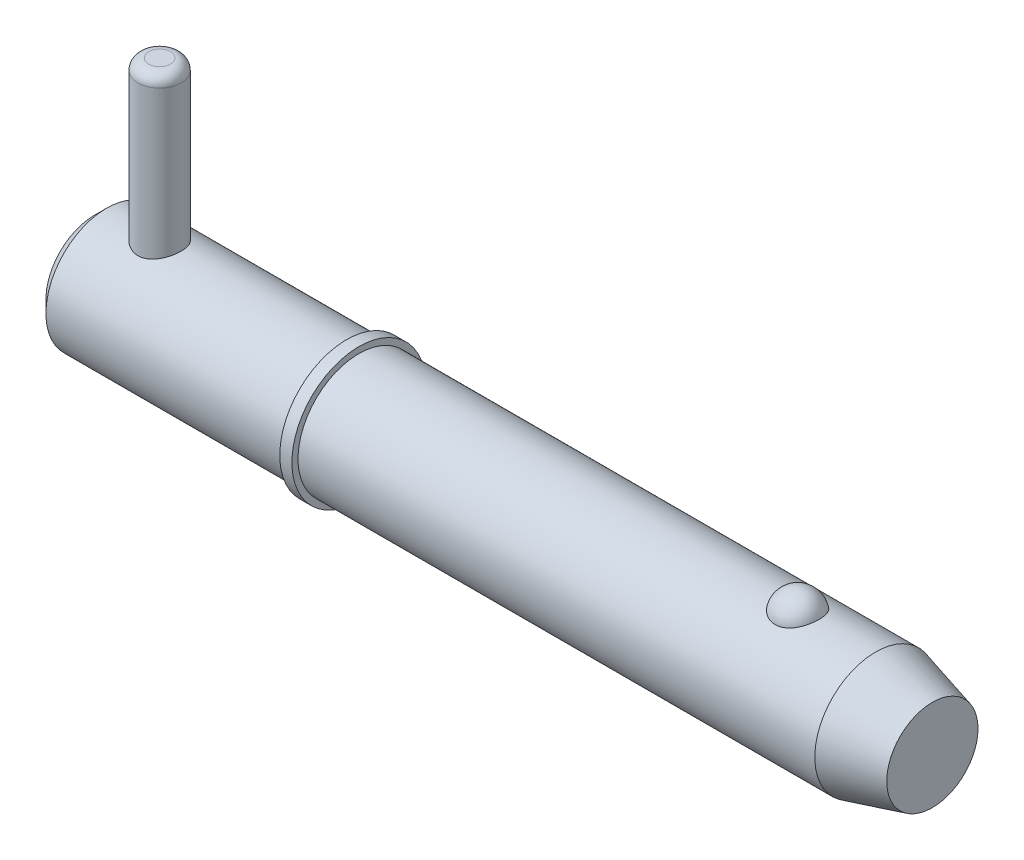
ISO-10303-21;
HEADER;
FILE_DESCRIPTION(('STEP AP214'),'2;1');
FILE_NAME('part.step','',(''),(''),'','','');
FILE_SCHEMA(('AUTOMOTIVE_DESIGN { 1 0 10303 214 1 1 1 1 }'));
ENDSEC;
DATA;
#1=APPLICATION_CONTEXT('core data for automotive mechanical design processes');
#2=APPLICATION_PROTOCOL_DEFINITION('international standard','automotive_design',2000,#1);
#3=PRODUCT_CONTEXT('',#1,'mechanical');
#4=PRODUCT('Part','Part','',(#3));
#5=PRODUCT_RELATED_PRODUCT_CATEGORY('part','',(#4));
#6=PRODUCT_DEFINITION_FORMATION('','',#4);
#7=PRODUCT_DEFINITION_CONTEXT('part definition',#1,'design');
#8=PRODUCT_DEFINITION('design','',#6,#7);
#9=PRODUCT_DEFINITION_SHAPE('','',#8);
#10=(LENGTH_UNIT() NAMED_UNIT(*) SI_UNIT(.MILLI.,.METRE.));
#11=(NAMED_UNIT(*) PLANE_ANGLE_UNIT() SI_UNIT($,.RADIAN.));
#12=(NAMED_UNIT(*) SI_UNIT($,.STERADIAN.) SOLID_ANGLE_UNIT());
#13=UNCERTAINTY_MEASURE_WITH_UNIT(LENGTH_MEASURE(1.E-05),#10,'distance_accuracy_value','');
#14=(GEOMETRIC_REPRESENTATION_CONTEXT(3) GLOBAL_UNCERTAINTY_ASSIGNED_CONTEXT((#13)) GLOBAL_UNIT_ASSIGNED_CONTEXT((#10,
#11,#12)) REPRESENTATION_CONTEXT('',''));
#15=CARTESIAN_POINT('',(0.,0.,0.));
#16=DIRECTION('',(0.,0.,1.));
#17=DIRECTION('',(1.,0.,0.));
#18=AXIS2_PLACEMENT_3D('',#15,#16,#17);
#19=CARTESIAN_POINT('',(5.94,19.845,0.));
#20=DIRECTION('',(0.,-1.,0.));
#21=DIRECTION('',(0.,0.,-1.));
#22=AXIS2_PLACEMENT_3D('',#19,#20,#21);
#23=CYLINDRICAL_SURFACE('',#22,1.98);
#24=CARTESIAN_POINT('',(5.94,-4.565,0.));
#25=DIRECTION('',(0.,1.,0.));
#26=DIRECTION('',(0.,0.,1.));
#27=AXIS2_PLACEMENT_3D('',#24,#25,#26);
#28=CIRCLE('',#27,1.98);
#29=CARTESIAN_POINT('',(5.94,-4.565,1.98));
#30=VERTEX_POINT('',#29);
#31=EDGE_CURVE('P0_E25',#30,#30,#28,.T.);
#32=ORIENTED_EDGE('',*,*,#31,.T.);
#33=EDGE_LOOP('',(#32));
#34=FACE_BOUND('',#33,.T.);
#35=CARTESIAN_POINT('',(5.94,18.855,0.));
#36=DIRECTION('',(0.,1.,0.));
#37=DIRECTION('',(0.,0.,1.));
#38=AXIS2_PLACEMENT_3D('',#35,#36,#37);
#39=CIRCLE('',#38,1.98);
#40=CARTESIAN_POINT('',(5.94,18.855,1.98));
#41=VERTEX_POINT('',#40);
#42=EDGE_CURVE('P0_E29',#41,#41,#39,.F.);
#43=ORIENTED_EDGE('',*,*,#42,.T.);
#44=EDGE_LOOP('',(#43));
#45=FACE_BOUND('',#44,.T.);
#46=ADVANCED_FACE('P0_F14',(#34,#45),#23,.T.);
#47=CARTESIAN_POINT('',(5.94,19.845,0.));
#48=DIRECTION('',(0.,1.,0.));
#49=DIRECTION('',(0.,0.,1.));
#50=AXIS2_PLACEMENT_3D('',#47,#48,#49);
#51=PLANE('',#50);
#52=CARTESIAN_POINT('',(5.94,19.845,0.));
#53=DIRECTION('',(0.,1.,0.));
#54=DIRECTION('',(0.,0.,1.));
#55=AXIS2_PLACEMENT_3D('',#52,#53,#54);
#56=CIRCLE('',#55,0.99);
#57=CARTESIAN_POINT('',(5.94,19.845,0.99));
#58=VERTEX_POINT('',#57);
#59=EDGE_CURVE('P0_E10',#58,#58,#56,.T.);
#60=ORIENTED_EDGE('',*,*,#59,.T.);
#61=EDGE_LOOP('',(#60));
#62=FACE_BOUND('',#61,.T.);
#63=ADVANCED_FACE('P0_F46',(#62),#51,.T.);
#64=CARTESIAN_POINT('',(5.94,-5.555,0.));
#65=DIRECTION('',(0.,1.,0.));
#66=DIRECTION('',(0.,0.,1.));
#67=AXIS2_PLACEMENT_3D('',#64,#65,#66);
#68=PLANE('',#67);
#69=CARTESIAN_POINT('',(5.94,-5.555,0.));
#70=DIRECTION('',(0.,1.,0.));
#71=DIRECTION('',(0.,0.,1.));
#72=AXIS2_PLACEMENT_3D('',#69,#70,#71);
#73=CIRCLE('',#72,0.99);
#74=CARTESIAN_POINT('',(5.94,-5.555,0.99));
#75=VERTEX_POINT('',#74);
#76=EDGE_CURVE('P0_E21',#75,#75,#73,.F.);
#77=ORIENTED_EDGE('',*,*,#76,.T.);
#78=EDGE_LOOP('',(#77));
#79=FACE_BOUND('',#78,.T.);
#80=ADVANCED_FACE('P0_F43',(#79),#68,.F.);
#81=CARTESIAN_POINT('',(5.94,-4.565,0.));
#82=DIRECTION('',(0.,1.,0.));
#83=DIRECTION('',(0.,0.,1.));
#84=AXIS2_PLACEMENT_3D('',#81,#82,#83);
#85=DEGENERATE_TOROIDAL_SURFACE('',#84,0.99,0.99,.T.);
#86=ORIENTED_EDGE('',*,*,#76,.F.);
#87=EDGE_LOOP('',(#86));
#88=FACE_BOUND('',#87,.T.);
#89=ORIENTED_EDGE('',*,*,#31,.F.);
#90=EDGE_LOOP('',(#89));
#91=FACE_BOUND('',#90,.T.);
#92=ADVANCED_FACE('P0_F38',(#88,#91),#85,.T.);
#93=CARTESIAN_POINT('',(5.94,18.855,0.));
#94=DIRECTION('',(0.,1.,0.));
#95=DIRECTION('',(0.,0.,1.));
#96=AXIS2_PLACEMENT_3D('',#93,#94,#95);
#97=DEGENERATE_TOROIDAL_SURFACE('',#96,0.99,0.99,.T.);
#98=ORIENTED_EDGE('',*,*,#42,.F.);
#99=EDGE_LOOP('',(#98));
#100=FACE_BOUND('',#99,.T.);
#101=ORIENTED_EDGE('',*,*,#59,.F.);
#102=EDGE_LOOP('',(#101));
#103=FACE_BOUND('',#102,.T.);
#104=ADVANCED_FACE('P0_F16',(#100,#103),#97,.T.);
#105=CLOSED_SHELL('',(#46,#63,#80,#92,#104));
#106=MANIFOLD_SOLID_BREP('P0_B1',#105);
#107=CARTESIAN_POINT('',(0.,0.,0.));
#108=DIRECTION('',(1.,0.,0.));
#109=DIRECTION('',(0.,0.,-1.));
#110=AXIS2_PLACEMENT_3D('',#107,#108,#109);
#111=CYLINDRICAL_SURFACE('',#110,5.555);
#112=CARTESIAN_POINT('',(71.3171144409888,0.,0.));
#113=DIRECTION('',(1.,0.,0.));
#114=DIRECTION('',(0.,0.,-1.));
#115=AXIS2_PLACEMENT_3D('',#112,#113,#114);
#116=CIRCLE('',#115,5.555);
#117=CARTESIAN_POINT('',(71.3171144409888,0.,-5.555));
#118=VERTEX_POINT('',#117);
#119=EDGE_CURVE('P1_E81',#118,#118,#116,.T.);
#120=ORIENTED_EDGE('',*,*,#119,.F.);
#121=EDGE_LOOP('',(#120));
#122=FACE_BOUND('',#121,.T.);
#123=CARTESIAN_POINT('',(24.13,0.,0.));
#124=DIRECTION('',(1.,0.,0.));
#125=DIRECTION('',(0.,0.,-1.));
#126=AXIS2_PLACEMENT_3D('',#123,#124,#125);
#127=CIRCLE('',#126,5.555);
#128=CARTESIAN_POINT('',(24.13,0.,-5.555));
#129=VERTEX_POINT('',#128);
#130=EDGE_CURVE('P1_E85',#129,#129,#127,.T.);
#131=ORIENTED_EDGE('',*,*,#130,.T.);
#132=EDGE_LOOP('',(#131));
#133=FACE_BOUND('',#132,.T.);
#134=CARTESIAN_POINT('',(64.1986264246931,5.16741224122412,2.03859650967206));
#135=CARTESIAN_POINT('',(64.0929492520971,5.16740893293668,2.03859990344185));
#136=CARTESIAN_POINT('',(63.98729894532,5.17079470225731,2.03008306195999));
#137=CARTESIAN_POINT('',(63.7791419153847,5.18392795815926,1.99630721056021));
#138=CARTESIAN_POINT('',(63.6766344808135,5.19367399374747,1.97105201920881));
#139=CARTESIAN_POINT('',(63.4777710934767,5.21839168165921,1.90463997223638));
#140=CARTESIAN_POINT('',(63.3814064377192,5.23335573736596,1.86350622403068));
#141=CARTESIAN_POINT('',(63.1970804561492,5.26688076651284,1.76652592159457));
#142=CARTESIAN_POINT('',(63.1091207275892,5.28544242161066,1.71067657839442));
#143=CARTESIAN_POINT('',(62.941265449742,5.32479845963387,1.58399959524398));
#144=CARTESIAN_POINT('',(62.8616656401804,5.34564089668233,1.5127954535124));
#145=CARTESIAN_POINT('',(62.7151290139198,5.38697258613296,1.3582858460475));
#146=CARTESIAN_POINT('',(62.648194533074,5.40746177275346,1.27497815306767));
#147=CARTESIAN_POINT('',(62.5256103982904,5.44694508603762,1.09440293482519));
#148=CARTESIAN_POINT('',(62.4705989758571,5.46583143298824,0.996677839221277));
#149=CARTESIAN_POINT('',(62.3769376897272,5.49908030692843,0.79296193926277));
#150=CARTESIAN_POINT('',(62.3382894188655,5.513442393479,0.686970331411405));
#151=CARTESIAN_POINT('',(62.2776807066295,5.536358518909,0.468019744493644));
#152=CARTESIAN_POINT('',(62.2559725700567,5.54482455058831,0.354981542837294));
#153=CARTESIAN_POINT('',(62.2306362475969,5.55473324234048,0.126595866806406));
#154=CARTESIAN_POINT('',(62.2270077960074,5.55617600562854,0.0112484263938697));
#155=CARTESIAN_POINT('',(62.2378817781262,5.55189984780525,-0.218011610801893));
#156=CARTESIAN_POINT('',(62.2523151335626,5.54620821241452,-0.331928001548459));
#157=CARTESIAN_POINT('',(62.298903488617,5.52828920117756,-0.555544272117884));
#158=CARTESIAN_POINT('',(62.3310588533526,5.51606169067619,-0.665244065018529));
#159=CARTESIAN_POINT('',(62.4124883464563,5.48630779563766,-0.877469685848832));
#160=CARTESIAN_POINT('',(62.4617816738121,5.4687754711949,-0.97998731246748));
#161=CARTESIAN_POINT('',(62.5764785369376,5.43024700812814,-1.1748697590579));
#162=CARTESIAN_POINT('',(62.6418831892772,5.4092506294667,-1.26723387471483));
#163=CARTESIAN_POINT('',(62.7875712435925,5.36600927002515,-1.43940133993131));
#164=CARTESIAN_POINT('',(62.8678859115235,5.34376173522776,-1.51917763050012));
#165=CARTESIAN_POINT('',(63.0414520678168,5.30057971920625,-1.66360338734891));
#166=CARTESIAN_POINT('',(63.134702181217,5.27964509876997,-1.72825445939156));
#167=CARTESIAN_POINT('',(63.3293939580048,5.24205250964,-1.83909478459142));
#168=CARTESIAN_POINT('',(63.4305900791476,5.22530519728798,-1.88568407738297));
#169=CARTESIAN_POINT('',(63.6401552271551,5.19750919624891,-1.96100802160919));
#170=CARTESIAN_POINT('',(63.7485215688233,5.1864583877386,-1.98974931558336));
#171=CARTESIAN_POINT('',(63.9634989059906,5.17184410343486,-2.02742262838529));
#172=CARTESIAN_POINT('',(64.069925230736,5.1679328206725,-2.03727608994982));
#173=CARTESIAN_POINT('',(64.2829925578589,5.16698995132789,-2.03966777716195));
#174=CARTESIAN_POINT('',(64.3896335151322,5.16995704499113,-2.03220932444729));
#175=CARTESIAN_POINT('',(64.5967730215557,5.18222383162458,-2.00071170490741));
#176=CARTESIAN_POINT('',(64.6973599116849,5.19133213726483,-1.97717337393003));
#177=CARTESIAN_POINT('',(64.8930141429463,5.21467637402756,-1.91475248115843));
#178=CARTESIAN_POINT('',(64.9880810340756,5.22891272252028,-1.8758686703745));
#179=CARTESIAN_POINT('',(65.1723711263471,5.26137066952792,-1.78282713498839));
#180=CARTESIAN_POINT('',(65.2614190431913,5.27967329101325,-1.72835124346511));
#181=CARTESIAN_POINT('',(65.4292880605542,5.31817411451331,-1.60597483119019));
#182=CARTESIAN_POINT('',(65.5081068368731,5.33837274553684,-1.53807126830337));
#183=CARTESIAN_POINT('',(65.6575156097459,5.37968287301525,-1.38688970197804));
#184=CARTESIAN_POINT('',(65.7275058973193,5.40079011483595,-1.30301744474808));
#185=CARTESIAN_POINT('',(65.8530125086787,5.44074401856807,-1.12458170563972));
#186=CARTESIAN_POINT('',(65.9085262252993,5.4595902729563,-1.03001630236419));
#187=CARTESIAN_POINT('',(66.0055507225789,5.49369849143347,-0.829439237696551));
#188=CARTESIAN_POINT('',(66.0465483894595,5.50882422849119,-0.723155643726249));
#189=CARTESIAN_POINT('',(66.1111250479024,5.53310911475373,-0.504772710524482));
#190=CARTESIAN_POINT('',(66.1347036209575,5.54226812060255,-0.392673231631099));
#191=CARTESIAN_POINT('',(66.164013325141,5.55370358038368,-0.165459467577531));
#192=CARTESIAN_POINT('',(66.1696884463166,5.55595843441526,-0.0503368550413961));
#193=CARTESIAN_POINT('',(66.162916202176,5.55329317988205,0.179288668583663));
#194=CARTESIAN_POINT('',(66.1504690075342,5.54837313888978,0.293791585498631));
#195=CARTESIAN_POINT('',(66.1077798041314,5.53189037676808,0.51852641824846));
#196=CARTESIAN_POINT('',(66.077598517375,5.5203503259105,0.628771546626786));
#197=CARTESIAN_POINT('',(66.0000962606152,5.49182453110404,0.842318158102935));
#198=CARTESIAN_POINT('',(65.9527743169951,5.47483847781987,0.945619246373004));
#199=CARTESIAN_POINT('',(65.8417204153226,5.43710633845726,1.14281571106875));
#200=CARTESIAN_POINT('',(65.777921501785,5.41634501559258,1.23667048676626));
#201=CARTESIAN_POINT('',(65.6353577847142,5.37334572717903,1.41185243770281));
#202=CARTESIAN_POINT('',(65.5565932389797,5.35110778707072,1.4931798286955));
#203=CARTESIAN_POINT('',(65.3864234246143,5.30779474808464,1.64049162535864));
#204=CARTESIAN_POINT('',(65.2951002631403,5.28671324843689,1.7065687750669));
#205=CARTESIAN_POINT('',(65.1017390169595,5.24804852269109,1.82201372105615));
#206=CARTESIAN_POINT('',(64.9997005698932,5.23046541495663,1.87138095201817));
#207=CARTESIAN_POINT('',(64.7836187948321,5.20042692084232,1.95335298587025));
#208=CARTESIAN_POINT('',(64.669260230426,5.18820192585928,1.98521734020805));
#209=CARTESIAN_POINT('',(64.4361307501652,5.17169804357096,2.02783294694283));
#210=CARTESIAN_POINT('',(64.3173616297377,5.16741595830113,2.03859269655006));
#211=CARTESIAN_POINT('',(64.1986264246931,5.16741224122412,2.03859650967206));
#212=B_SPLINE_CURVE_WITH_KNOTS('',3,(#134,#135,#136,#137,#138,#139,#140,#141,#142,#143,#144,
#145,#146,#147,#148,#149,#150,#151,#152,#153,#154,#155,#156,#157,#158,#159,#160,#161,#162,#163,
#164,#165,#166,#167,#168,#169,#170,#171,#172,#173,#174,#175,#176,#177,#178,#179,#180,#181,#182,
#183,#184,#185,#186,#187,#188,#189,#190,#191,#192,#193,#194,#195,#196,#197,#198,#199,#200,#201,
#202,#203,#204,#205,#206,#207,#208,#209,#210,#211),.UNSPECIFIED.,.T.,.F.,(4,2,2,2,2,2,2,2,2,2,2,
2,2,2,2,2,2,2,2,2,2,2,2,2,2,2,2,2,2,2,2,2,2,2,2,2,2,2,4),(0.,0.316595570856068,
0.633118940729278,0.949183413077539,1.26530783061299,1.59030762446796,1.91536729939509,
2.25495824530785,2.59458224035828,2.93917283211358,3.28375835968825,3.62703002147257,
3.97030875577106,4.31397329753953,4.657661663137,5.00207904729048,5.34645984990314,
5.68270547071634,6.01882587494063,6.33808403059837,6.65728093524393,6.96696376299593,
7.27667180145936,7.59321535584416,7.90983070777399,8.24210387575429,8.5744368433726,
8.9175589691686,9.26068933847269,9.60489211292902,9.94909164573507,10.2921194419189,
10.6351667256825,10.9796305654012,11.3240884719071,11.6663928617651,12.0087088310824,
12.3645679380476,12.7202837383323),.UNSPECIFIED.);
#213=CARTESIAN_POINT('',(64.1986264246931,5.16741224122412,2.03859650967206));
#214=VERTEX_POINT('',#213);
#215=EDGE_CURVE('P1_E35',#214,#214,#212,.T.);
#216=ORIENTED_EDGE('',*,*,#215,.T.);
#217=EDGE_LOOP('',(#216));
#218=FACE_BOUND('',#217,.T.);
#219=ADVANCED_FACE('P1_F13',(#122,#133,#218),#111,.T.);
#220=CARTESIAN_POINT('',(0.,0.,0.));
#221=DIRECTION('',(-1.,0.,0.));
#222=DIRECTION('',(0.,0.,1.));
#223=AXIS2_PLACEMENT_3D('',#220,#221,#222);
#224=PLANE('',#223);
#225=CARTESIAN_POINT('',(0.,0.,0.));
#226=DIRECTION('',(1.,0.,0.));
#227=DIRECTION('',(0.,0.,-1.));
#228=AXIS2_PLACEMENT_3D('',#225,#226,#227);
#229=CIRCLE('',#228,4.444);
#230=CARTESIAN_POINT('',(0.,0.,-4.444));
#231=VERTEX_POINT('',#230);
#232=EDGE_CURVE('P1_E9',#231,#231,#229,.T.);
#233=ORIENTED_EDGE('',*,*,#232,.F.);
#234=EDGE_LOOP('',(#233));
#235=FACE_BOUND('',#234,.T.);
#236=ADVANCED_FACE('P1_F15',(#235),#224,.T.);
#237=CARTESIAN_POINT('',(1.111,0.,0.));
#238=DIRECTION('',(1.,0.,0.));
#239=DIRECTION('',(0.,0.,-1.));
#240=AXIS2_PLACEMENT_3D('',#237,#238,#239);
#241=CONICAL_SURFACE('',#240,5.555,0.78539816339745);
#242=ORIENTED_EDGE('',*,*,#232,.T.);
#243=EDGE_LOOP('',(#242));
#244=FACE_BOUND('',#243,.T.);
#245=CARTESIAN_POINT('',(1.111,0.,0.));
#246=DIRECTION('',(1.,0.,0.));
#247=DIRECTION('',(0.,0.,-1.));
#248=AXIS2_PLACEMENT_3D('',#245,#246,#247);
#249=CIRCLE('',#248,5.555);
#250=CARTESIAN_POINT('',(1.111,0.,-5.555));
#251=VERTEX_POINT('',#250);
#252=EDGE_CURVE('P1_E26',#251,#251,#249,.T.);
#253=ORIENTED_EDGE('',*,*,#252,.F.);
#254=EDGE_LOOP('',(#253));
#255=FACE_BOUND('',#254,.T.);
#256=ADVANCED_FACE('P1_F77',(#244,#255),#241,.T.);
#257=CARTESIAN_POINT('',(0.,0.,0.));
#258=DIRECTION('',(1.,0.,0.));
#259=DIRECTION('',(0.,0.,-1.));
#260=AXIS2_PLACEMENT_3D('',#257,#258,#259);
#261=CYLINDRICAL_SURFACE('',#260,5.555);
#262=CARTESIAN_POINT('',(5.94,-5.19014691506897,1.98));
#263=CARTESIAN_POINT('',(5.83264687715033,-5.19014494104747,1.98000226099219));
#264=CARTESIAN_POINT('',(5.7253094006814,-5.19351395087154,1.97123988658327));
#265=CARTESIAN_POINT('',(5.51384517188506,-5.20654291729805,1.93656219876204));
#266=CARTESIAN_POINT('',(5.40971858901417,-5.21620320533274,1.91064598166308));
#267=CARTESIAN_POINT('',(5.20778082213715,-5.24058443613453,1.84271148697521));
#268=CARTESIAN_POINT('',(5.10995634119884,-5.25529427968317,1.80072850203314));
#269=CARTESIAN_POINT('',(4.92270352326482,-5.28810012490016,1.70197537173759));
#270=CARTESIAN_POINT('',(4.83327743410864,-5.3061970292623,1.64520128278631));
#271=CARTESIAN_POINT('',(4.66135184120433,-5.34464714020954,1.51575187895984));
#272=CARTESIAN_POINT('',(4.57928277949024,-5.36506222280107,1.44252311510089));
#273=CARTESIAN_POINT('',(4.42829115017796,-5.40532920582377,1.28342047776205));
#274=CARTESIAN_POINT('',(4.35937105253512,-5.42518099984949,1.19754423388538));
#275=CARTESIAN_POINT('',(4.23461605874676,-5.46281133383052,1.01237205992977));
#276=CARTESIAN_POINT('',(4.17924129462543,-5.48050875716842,0.912748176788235));
#277=CARTESIAN_POINT('',(4.0862117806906,-5.51109938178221,0.70485824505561));
#278=CARTESIAN_POINT('',(4.0485515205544,-5.52399407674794,0.596594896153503));
#279=CARTESIAN_POINT('',(3.99350662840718,-5.54308759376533,0.379019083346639));
#280=CARTESIAN_POINT('',(3.97538263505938,-5.54952987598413,0.269915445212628));
#281=CARTESIAN_POINT('',(3.95756405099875,-5.55586205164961,0.0500378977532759));
#282=CARTESIAN_POINT('',(3.95786404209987,-5.55575387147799,-0.060735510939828));
#283=CARTESIAN_POINT('',(3.97643665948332,-5.54915684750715,-0.275539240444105));
#284=CARTESIAN_POINT('',(3.99390415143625,-5.54295384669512,-0.379649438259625));
#285=CARTESIAN_POINT('',(4.0449721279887,-5.52523170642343,-0.583350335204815));
#286=CARTESIAN_POINT('',(4.07857373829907,-5.51371219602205,-0.682940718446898));
#287=CARTESIAN_POINT('',(4.16137312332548,-5.4863099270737,-0.876423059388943));
#288=CARTESIAN_POINT('',(4.2107826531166,-5.47036834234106,-0.970215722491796));
#289=CARTESIAN_POINT('',(4.32361427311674,-5.43575653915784,-1.1484017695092));
#290=CARTESIAN_POINT('',(4.38704062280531,-5.41708549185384,-1.23279228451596));
#291=CARTESIAN_POINT('',(4.53006791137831,-5.37778429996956,-1.39454579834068));
#292=CARTESIAN_POINT('',(4.61035105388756,-5.35710277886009,-1.4712940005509));
#293=CARTESIAN_POINT('',(4.78279835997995,-5.31692766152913,-1.6104545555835));
#294=CARTESIAN_POINT('',(4.874964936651,-5.29743430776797,-1.67286398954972));
#295=CARTESIAN_POINT('',(5.07076688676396,-5.26153775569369,-1.78259698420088));
#296=CARTESIAN_POINT('',(5.17458163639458,-5.24519780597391,-1.8296227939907));
#297=CARTESIAN_POINT('',(5.38938990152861,-5.21818744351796,-1.90530278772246));
#298=CARTESIAN_POINT('',(5.50037985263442,-5.20751423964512,-1.93396601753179));
#299=CARTESIAN_POINT('',(5.72036376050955,-5.19369176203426,-1.97077654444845));
#300=CARTESIAN_POINT('',(5.82917370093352,-5.19018851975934,-1.97989015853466));
#301=CARTESIAN_POINT('',(6.04680100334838,-5.19010609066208,-1.98010779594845));
#302=CARTESIAN_POINT('',(6.15561835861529,-5.19352540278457,-1.97121572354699));
#303=CARTESIAN_POINT('',(6.36548036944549,-5.20654623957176,-1.93654727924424));
#304=CARTESIAN_POINT('',(6.46666051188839,-5.21588705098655,-1.91148218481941));
#305=CARTESIAN_POINT('',(6.66334537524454,-5.23939939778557,-1.84605494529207));
#306=CARTESIAN_POINT('',(6.75884899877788,-5.25357186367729,-1.8056898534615));
#307=CARTESIAN_POINT('',(6.94517989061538,-5.28576258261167,-1.70921153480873));
#308=CARTESIAN_POINT('',(7.03572661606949,-5.30389804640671,-1.65259670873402));
#309=CARTESIAN_POINT('',(7.20638087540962,-5.34176077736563,-1.52577523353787));
#310=CARTESIAN_POINT('',(7.28648490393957,-5.36148857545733,-1.45556404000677));
#311=CARTESIAN_POINT('',(7.43864697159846,-5.40165494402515,-1.2988614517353));
#312=CARTESIAN_POINT('',(7.50999887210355,-5.42207106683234,-1.21167640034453));
#313=CARTESIAN_POINT('',(7.63712639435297,-5.46023601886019,-1.026066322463));
#314=CARTESIAN_POINT('',(7.69290228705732,-5.47798489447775,-0.927641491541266));
#315=CARTESIAN_POINT('',(7.78684673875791,-5.50876590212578,-0.722633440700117));
#316=CARTESIAN_POINT('',(7.82510508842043,-5.52182201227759,-0.616095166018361));
#317=CARTESIAN_POINT('',(7.88297051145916,-5.54184206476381,-0.397530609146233));
#318=CARTESIAN_POINT('',(7.90258540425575,-5.5488085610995,-0.285506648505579));
#319=CARTESIAN_POINT('',(7.9218262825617,-5.55564472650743,-0.065566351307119));
#320=CARTESIAN_POINT('',(7.92245987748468,-5.55587212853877,0.0422515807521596));
#321=CARTESIAN_POINT('',(7.90626329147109,-5.55011340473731,0.256387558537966));
#322=CARTESIAN_POINT('',(7.88943488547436,-5.54412791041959,0.362705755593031));
#323=CARTESIAN_POINT('',(7.83948457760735,-5.52676548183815,0.568649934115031));
#324=CARTESIAN_POINT('',(7.8067003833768,-5.51550046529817,0.668367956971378));
#325=CARTESIAN_POINT('',(7.72609369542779,-5.48874437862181,0.860911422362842));
#326=CARTESIAN_POINT('',(7.67826838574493,-5.47325251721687,0.953735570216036));
#327=CARTESIAN_POINT('',(7.56675024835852,-5.43884382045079,1.13391068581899));
#328=CARTESIAN_POINT('',(7.50249968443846,-5.41981485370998,1.22089468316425));
#329=CARTESIAN_POINT('',(7.36086495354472,-5.38069275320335,1.38316665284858));
#330=CARTESIAN_POINT('',(7.28347630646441,-5.36059925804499,1.45845061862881));
#331=CARTESIAN_POINT('',(7.11347587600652,-5.32048380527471,1.59876646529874));
#332=CARTESIAN_POINT('',(7.02032386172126,-5.30050854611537,1.66315951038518));
#333=CARTESIAN_POINT('',(6.82388804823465,-5.26398994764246,1.77536801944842));
#334=CARTESIAN_POINT('',(6.7206049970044,-5.24744635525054,1.82318470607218));
#335=CARTESIAN_POINT('',(6.50639706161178,-5.21987969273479,1.90068230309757));
#336=CARTESIAN_POINT('',(6.3954529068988,-5.20887116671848,1.93031547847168));
#337=CARTESIAN_POINT('',(6.16966522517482,-5.19400760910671,1.96996824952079));
#338=CARTESIAN_POINT('',(6.05482366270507,-5.19014902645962,1.97999758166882));
#339=CARTESIAN_POINT('',(5.94,-5.19014691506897,1.98));
#340=B_SPLINE_CURVE_WITH_KNOTS('',3,(#262,#263,#264,#265,#266,#267,#268,#269,#270,#271,#272,
#273,#274,#275,#276,#277,#278,#279,#280,#281,#282,#283,#284,#285,#286,#287,#288,#289,#290,#291,
#292,#293,#294,#295,#296,#297,#298,#299,#300,#301,#302,#303,#304,#305,#306,#307,#308,#309,#310,
#311,#312,#313,#314,#315,#316,#317,#318,#319,#320,#321,#322,#323,#324,#325,#326,#327,#328,#329,
#330,#331,#332,#333,#334,#335,#336,#337,#338,#339),.UNSPECIFIED.,.T.,.F.,(4,2,2,2,2,2,2,2,2,2,2,
2,2,2,2,2,2,2,2,2,2,2,2,2,2,2,2,2,2,2,2,2,2,2,2,2,2,2,4),(0.,0.321632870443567,
0.643282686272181,0.964229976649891,1.28526292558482,1.61937087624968,1.9535415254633,
2.29784481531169,2.64204093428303,2.97269632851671,3.30325448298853,3.61901541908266,
3.93479838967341,4.25500220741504,4.57530346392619,4.91268648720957,5.25013812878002,
5.59378026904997,5.93725299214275,6.26331481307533,6.58930593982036,6.90185604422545,
7.21446637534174,7.53801472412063,7.86167140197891,8.20353561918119,8.54539388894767,
8.88547970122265,9.22542281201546,9.54728637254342,9.86911722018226,10.1844146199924,
10.4997710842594,10.827730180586,11.1558013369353,11.499115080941,11.8424034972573,
12.1865892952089,12.5306041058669),.UNSPECIFIED.);
#341=CARTESIAN_POINT('',(5.94,-5.19014691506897,1.98));
#342=VERTEX_POINT('',#341);
#343=EDGE_CURVE('P1_E17',#342,#342,#340,.T.);
#344=ORIENTED_EDGE('',*,*,#343,.F.);
#345=EDGE_LOOP('',(#344));
#346=FACE_BOUND('',#345,.T.);
#347=CARTESIAN_POINT('',(5.94,5.19014691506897,1.98));
#348=CARTESIAN_POINT('',(6.04735312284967,5.19014494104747,1.98000226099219));
#349=CARTESIAN_POINT('',(6.1546905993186,5.19351395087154,1.97123988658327));
#350=CARTESIAN_POINT('',(6.36615482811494,5.20654291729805,1.93656219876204));
#351=CARTESIAN_POINT('',(6.47028141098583,5.21620320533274,1.91064598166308));
#352=CARTESIAN_POINT('',(6.67221917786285,5.24058443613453,1.84271148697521));
#353=CARTESIAN_POINT('',(6.77004365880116,5.25529427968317,1.80072850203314));
#354=CARTESIAN_POINT('',(6.95729647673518,5.28810012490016,1.70197537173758));
#355=CARTESIAN_POINT('',(7.04672256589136,5.3061970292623,1.64520128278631));
#356=CARTESIAN_POINT('',(7.21864815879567,5.34464714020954,1.51575187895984));
#357=CARTESIAN_POINT('',(7.30071722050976,5.36506222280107,1.44252311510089));
#358=CARTESIAN_POINT('',(7.45170884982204,5.40532920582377,1.28342047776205));
#359=CARTESIAN_POINT('',(7.52062894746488,5.42518099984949,1.19754423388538));
#360=CARTESIAN_POINT('',(7.64538394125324,5.46281133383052,1.01237205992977));
#361=CARTESIAN_POINT('',(7.70075870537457,5.48050875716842,0.912748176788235));
#362=CARTESIAN_POINT('',(7.7937882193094,5.51109938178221,0.704858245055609));
#363=CARTESIAN_POINT('',(7.8314484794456,5.52399407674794,0.596594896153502));
#364=CARTESIAN_POINT('',(7.88649337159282,5.54308759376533,0.379019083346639));
#365=CARTESIAN_POINT('',(7.90461736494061,5.54952987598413,0.269915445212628));
#366=CARTESIAN_POINT('',(7.92243594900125,5.55586205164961,0.0500378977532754));
#367=CARTESIAN_POINT('',(7.92213595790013,5.55575387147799,-0.0607355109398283));
#368=CARTESIAN_POINT('',(7.90356334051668,5.54915684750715,-0.275539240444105));
#369=CARTESIAN_POINT('',(7.88609584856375,5.54295384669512,-0.379649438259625));
#370=CARTESIAN_POINT('',(7.8350278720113,5.52523170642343,-0.583350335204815));
#371=CARTESIAN_POINT('',(7.80142626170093,5.51371219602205,-0.682940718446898));
#372=CARTESIAN_POINT('',(7.71862687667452,5.4863099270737,-0.876423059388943));
#373=CARTESIAN_POINT('',(7.6692173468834,5.47036834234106,-0.970215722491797));
#374=CARTESIAN_POINT('',(7.55638572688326,5.43575653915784,-1.1484017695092));
#375=CARTESIAN_POINT('',(7.49295937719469,5.41708549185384,-1.23279228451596));
#376=CARTESIAN_POINT('',(7.34993208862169,5.37778429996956,-1.39454579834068));
#377=CARTESIAN_POINT('',(7.26964894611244,5.35710277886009,-1.4712940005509));
#378=CARTESIAN_POINT('',(7.09720164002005,5.31692766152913,-1.6104545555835));
#379=CARTESIAN_POINT('',(7.00503506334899,5.29743430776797,-1.67286398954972));
#380=CARTESIAN_POINT('',(6.80923311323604,5.26153775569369,-1.78259698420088));
#381=CARTESIAN_POINT('',(6.70541836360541,5.24519780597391,-1.8296227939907));
#382=CARTESIAN_POINT('',(6.49061009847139,5.21818744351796,-1.90530278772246));
#383=CARTESIAN_POINT('',(6.37962014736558,5.20751423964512,-1.93396601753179));
#384=CARTESIAN_POINT('',(6.15963623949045,5.19369176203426,-1.97077654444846));
#385=CARTESIAN_POINT('',(6.05082629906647,5.19018851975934,-1.97989015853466));
#386=CARTESIAN_POINT('',(5.83319899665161,5.19010609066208,-1.98010779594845));
#387=CARTESIAN_POINT('',(5.7243816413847,5.19352540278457,-1.97121572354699));
#388=CARTESIAN_POINT('',(5.5145196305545,5.20654623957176,-1.93654727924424));
#389=CARTESIAN_POINT('',(5.4133394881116,5.21588705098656,-1.91148218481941));
#390=CARTESIAN_POINT('',(5.21665462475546,5.23939939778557,-1.84605494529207));
#391=CARTESIAN_POINT('',(5.12115100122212,5.25357186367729,-1.8056898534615));
#392=CARTESIAN_POINT('',(4.93482010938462,5.28576258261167,-1.70921153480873));
#393=CARTESIAN_POINT('',(4.84427338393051,5.30389804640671,-1.65259670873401));
#394=CARTESIAN_POINT('',(4.67361912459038,5.34176077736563,-1.52577523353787));
#395=CARTESIAN_POINT('',(4.59351509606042,5.36148857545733,-1.45556404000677));
#396=CARTESIAN_POINT('',(4.44135302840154,5.40165494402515,-1.2988614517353));
#397=CARTESIAN_POINT('',(4.37000112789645,5.42207106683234,-1.21167640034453));
#398=CARTESIAN_POINT('',(4.24287360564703,5.46023601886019,-1.026066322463));
#399=CARTESIAN_POINT('',(4.18709771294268,5.47798489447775,-0.927641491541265));
#400=CARTESIAN_POINT('',(4.09315326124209,5.50876590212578,-0.722633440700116));
#401=CARTESIAN_POINT('',(4.05489491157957,5.52182201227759,-0.61609516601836));
#402=CARTESIAN_POINT('',(3.99702948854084,5.54184206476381,-0.397530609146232));
#403=CARTESIAN_POINT('',(3.97741459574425,5.5488085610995,-0.285506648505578));
#404=CARTESIAN_POINT('',(3.9581737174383,5.55564472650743,-0.0655663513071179));
#405=CARTESIAN_POINT('',(3.95754012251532,5.55587212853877,0.0422515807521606));
#406=CARTESIAN_POINT('',(3.97373670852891,5.55011340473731,0.256387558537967));
#407=CARTESIAN_POINT('',(3.99056511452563,5.54412791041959,0.362705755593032));
#408=CARTESIAN_POINT('',(4.04051542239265,5.52676548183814,0.568649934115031));
#409=CARTESIAN_POINT('',(4.07329961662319,5.51550046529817,0.668367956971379));
#410=CARTESIAN_POINT('',(4.15390630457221,5.48874437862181,0.860911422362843));
#411=CARTESIAN_POINT('',(4.20173161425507,5.47325251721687,0.953735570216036));
#412=CARTESIAN_POINT('',(4.31324975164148,5.43884382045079,1.13391068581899));
#413=CARTESIAN_POINT('',(4.37750031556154,5.41981485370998,1.22089468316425));
#414=CARTESIAN_POINT('',(4.51913504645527,5.38069275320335,1.38316665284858));
#415=CARTESIAN_POINT('',(4.59652369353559,5.36059925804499,1.45845061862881));
#416=CARTESIAN_POINT('',(4.76652412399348,5.32048380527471,1.59876646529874));
#417=CARTESIAN_POINT('',(4.85967613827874,5.30050854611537,1.66315951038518));
#418=CARTESIAN_POINT('',(5.05611195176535,5.26398994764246,1.77536801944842));
#419=CARTESIAN_POINT('',(5.1593950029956,5.24744635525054,1.82318470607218));
#420=CARTESIAN_POINT('',(5.37360293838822,5.21987969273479,1.90068230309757));
#421=CARTESIAN_POINT('',(5.4845470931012,5.20887116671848,1.93031547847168));
#422=CARTESIAN_POINT('',(5.71033477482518,5.19400760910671,1.96996824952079));
#423=CARTESIAN_POINT('',(5.82517633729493,5.19014902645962,1.97999758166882));
#424=CARTESIAN_POINT('',(5.94,5.19014691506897,1.98));
#425=B_SPLINE_CURVE_WITH_KNOTS('',3,(#347,#348,#349,#350,#351,#352,#353,#354,#355,#356,#357,
#358,#359,#360,#361,#362,#363,#364,#365,#366,#367,#368,#369,#370,#371,#372,#373,#374,#375,#376,
#377,#378,#379,#380,#381,#382,#383,#384,#385,#386,#387,#388,#389,#390,#391,#392,#393,#394,#395,
#396,#397,#398,#399,#400,#401,#402,#403,#404,#405,#406,#407,#408,#409,#410,#411,#412,#413,#414,
#415,#416,#417,#418,#419,#420,#421,#422,#423,#424),.UNSPECIFIED.,.T.,.F.,(4,2,2,2,2,2,2,2,2,2,2,
2,2,2,2,2,2,2,2,2,2,2,2,2,2,2,2,2,2,2,2,2,2,2,2,2,2,2,4),(0.,0.321632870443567,
0.643282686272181,0.964229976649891,1.28526292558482,1.61937087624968,1.9535415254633,
2.29784481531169,2.64204093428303,2.97269632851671,3.30325448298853,3.61901541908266,
3.93479838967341,4.25500220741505,4.57530346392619,4.91268648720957,5.25013812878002,
5.59378026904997,5.93725299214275,6.26331481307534,6.58930593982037,6.90185604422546,
7.21446637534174,7.53801472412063,7.86167140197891,8.20353561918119,8.54539388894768,
8.88547970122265,9.22542281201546,9.54728637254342,9.86911722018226,10.1844146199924,
10.4997710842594,10.827730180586,11.1558013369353,11.499115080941,11.8424034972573,
12.1865892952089,12.5306041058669),.UNSPECIFIED.);
#426=CARTESIAN_POINT('',(5.94,5.19014691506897,1.98));
#427=VERTEX_POINT('',#426);
#428=EDGE_CURVE('P1_E43',#427,#427,#425,.T.);
#429=ORIENTED_EDGE('',*,*,#428,.F.);
#430=EDGE_LOOP('',(#429));
#431=FACE_BOUND('',#430,.T.);
#432=ORIENTED_EDGE('',*,*,#252,.T.);
#433=EDGE_LOOP('',(#432));
#434=FACE_BOUND('',#433,.T.);
#435=CARTESIAN_POINT('',(23.019,0.,0.));
#436=DIRECTION('',(1.,0.,0.));
#437=DIRECTION('',(0.,0.,-1.));
#438=AXIS2_PLACEMENT_3D('',#435,#436,#437);
#439=CIRCLE('',#438,5.555);
#440=CARTESIAN_POINT('',(23.019,0.,-5.555));
#441=VERTEX_POINT('',#440);
#442=EDGE_CURVE('P1_E31',#441,#441,#439,.T.);
#443=ORIENTED_EDGE('',*,*,#442,.F.);
#444=EDGE_LOOP('',(#443));
#445=FACE_BOUND('',#444,.T.);
#446=ADVANCED_FACE('P1_F103',(#346,#431,#434,#445),#261,.T.);
#447=CARTESIAN_POINT('',(23.019,5.555,0.));
#448=DIRECTION('',(-1.,0.,0.));
#449=DIRECTION('',(0.,0.,1.));
#450=AXIS2_PLACEMENT_3D('',#447,#448,#449);
#451=PLANE('',#450);
#452=ORIENTED_EDGE('',*,*,#442,.T.);
#453=EDGE_LOOP('',(#452));
#454=FACE_BOUND('',#453,.T.);
#455=CARTESIAN_POINT('',(23.019,0.,0.));
#456=DIRECTION('',(1.,0.,0.));
#457=DIRECTION('',(0.,0.,-1.));
#458=AXIS2_PLACEMENT_3D('',#455,#456,#457);
#459=CIRCLE('',#458,6.1105);
#460=CARTESIAN_POINT('',(23.019,0.,-6.1105));
#461=VERTEX_POINT('',#460);
#462=EDGE_CURVE('P1_E91',#461,#461,#459,.T.);
#463=ORIENTED_EDGE('',*,*,#462,.F.);
#464=EDGE_LOOP('',(#463));
#465=FACE_BOUND('',#464,.T.);
#466=ADVANCED_FACE('P1_F100',(#454,#465),#451,.T.);
#467=CARTESIAN_POINT('',(0.,0.,0.));
#468=DIRECTION('',(1.,0.,0.));
#469=DIRECTION('',(0.,0.,-1.));
#470=AXIS2_PLACEMENT_3D('',#467,#468,#469);
#471=CYLINDRICAL_SURFACE('',#470,6.1105);
#472=ORIENTED_EDGE('',*,*,#462,.T.);
#473=EDGE_LOOP('',(#472));
#474=FACE_BOUND('',#473,.T.);
#475=CARTESIAN_POINT('',(24.13,0.,0.));
#476=DIRECTION('',(1.,0.,0.));
#477=DIRECTION('',(0.,0.,-1.));
#478=AXIS2_PLACEMENT_3D('',#475,#476,#477);
#479=CIRCLE('',#478,6.1105);
#480=CARTESIAN_POINT('',(24.13,0.,-6.1105));
#481=VERTEX_POINT('',#480);
#482=EDGE_CURVE('P1_E88',#481,#481,#479,.T.);
#483=ORIENTED_EDGE('',*,*,#482,.F.);
#484=EDGE_LOOP('',(#483));
#485=FACE_BOUND('',#484,.T.);
#486=ADVANCED_FACE('P1_F68',(#474,#485),#471,.T.);
#487=CARTESIAN_POINT('',(24.13,6.1105,0.));
#488=DIRECTION('',(1.,0.,0.));
#489=DIRECTION('',(0.,0.,-1.));
#490=AXIS2_PLACEMENT_3D('',#487,#488,#489);
#491=PLANE('',#490);
#492=ORIENTED_EDGE('',*,*,#482,.T.);
#493=EDGE_LOOP('',(#492));
#494=FACE_BOUND('',#493,.T.);
#495=ORIENTED_EDGE('',*,*,#130,.F.);
#496=EDGE_LOOP('',(#495));
#497=FACE_BOUND('',#496,.T.);
#498=ADVANCED_FACE('P1_F62',(#494,#497),#491,.T.);
#499=CARTESIAN_POINT('',(76.5,0.,0.));
#500=DIRECTION('',(-1.,0.,0.));
#501=DIRECTION('',(0.,0.,1.));
#502=AXIS2_PLACEMENT_3D('',#499,#500,#501);
#503=CONICAL_SURFACE('',#502,4.16625000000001,0.26179938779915);
#504=ORIENTED_EDGE('',*,*,#119,.T.);
#505=EDGE_LOOP('',(#504));
#506=FACE_BOUND('',#505,.T.);
#507=CARTESIAN_POINT('',(76.5,0.,0.));
#508=DIRECTION('',(1.,0.,0.));
#509=DIRECTION('',(0.,0.,-1.));
#510=AXIS2_PLACEMENT_3D('',#507,#508,#509);
#511=CIRCLE('',#510,4.16625000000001);
#512=CARTESIAN_POINT('',(76.5,0.,-4.16625000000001));
#513=VERTEX_POINT('',#512);
#514=EDGE_CURVE('P1_E42',#513,#513,#511,.T.);
#515=ORIENTED_EDGE('',*,*,#514,.F.);
#516=EDGE_LOOP('',(#515));
#517=FACE_BOUND('',#516,.T.);
#518=ADVANCED_FACE('P1_F59',(#506,#517),#503,.T.);
#519=CARTESIAN_POINT('',(76.5,4.16625000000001,0.));
#520=DIRECTION('',(1.,0.,0.));
#521=DIRECTION('',(0.,0.,-1.));
#522=AXIS2_PLACEMENT_3D('',#519,#520,#521);
#523=PLANE('',#522);
#524=ORIENTED_EDGE('',*,*,#514,.T.);
#525=EDGE_LOOP('',(#524));
#526=FACE_BOUND('',#525,.T.);
#527=ADVANCED_FACE('P1_F55',(#526),#523,.T.);
#528=CARTESIAN_POINT('',(64.1986264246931,4.9995,0.));
#529=DIRECTION('',(-1.,0.,0.));
#530=DIRECTION('',(0.,1.,0.));
#531=AXIS2_PLACEMENT_3D('',#528,#529,#530);
#532=SPHERICAL_SURFACE('',#531,2.0455);
#533=ORIENTED_EDGE('',*,*,#215,.F.);
#534=EDGE_LOOP('',(#533));
#535=FACE_BOUND('',#534,.T.);
#536=ADVANCED_FACE('P1_F50',(#535),#532,.T.);
#537=CARTESIAN_POINT('',(5.94,-6.1105,0.));
#538=DIRECTION('',(0.,1.,0.));
#539=DIRECTION('',(0.,0.,1.));
#540=AXIS2_PLACEMENT_3D('',#537,#538,#539);
#541=CYLINDRICAL_SURFACE('',#540,1.98);
#542=ORIENTED_EDGE('',*,*,#343,.T.);
#543=EDGE_LOOP('',(#542));
#544=FACE_BOUND('',#543,.T.);
#545=ORIENTED_EDGE('',*,*,#428,.T.);
#546=EDGE_LOOP('',(#545));
#547=FACE_BOUND('',#546,.T.);
#548=ADVANCED_FACE('P1_F54',(#544,#547),#541,.F.);
#549=CLOSED_SHELL('',(#219,#236,#256,#446,#466,#486,#498,#518,#527,#536,#548));
#550=MANIFOLD_SOLID_BREP('P1_B1',#549);
#551=ADVANCED_BREP_SHAPE_REPRESENTATION('',(#18,#106,#550),#14);
#552=SHAPE_DEFINITION_REPRESENTATION(#9,#551);
ENDSEC;
END-ISO-10303-21;
